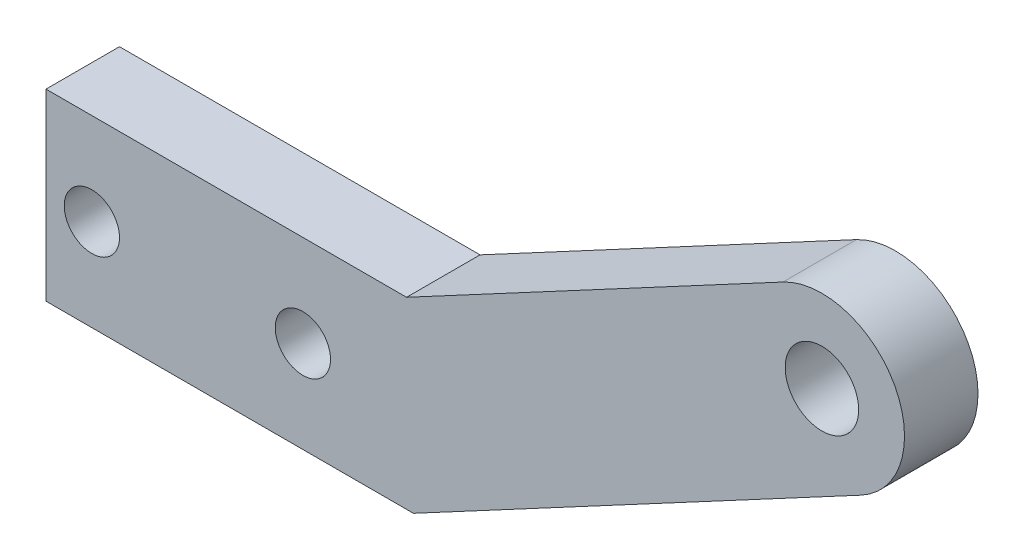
ISO-10303-21;
HEADER;
FILE_DESCRIPTION(('STEP AP214'),'2;1');
FILE_NAME('part.step','',(''),(''),'','','');
FILE_SCHEMA(('AUTOMOTIVE_DESIGN { 1 0 10303 214 1 1 1 1 }'));
ENDSEC;
DATA;
#1=APPLICATION_CONTEXT('core data for automotive mechanical design processes');
#2=APPLICATION_PROTOCOL_DEFINITION('international standard','automotive_design',2000,#1);
#3=PRODUCT_CONTEXT('',#1,'mechanical');
#4=PRODUCT('Part','Part','',(#3));
#5=PRODUCT_RELATED_PRODUCT_CATEGORY('part','',(#4));
#6=PRODUCT_DEFINITION_FORMATION('','',#4);
#7=PRODUCT_DEFINITION_CONTEXT('part definition',#1,'design');
#8=PRODUCT_DEFINITION('design','',#6,#7);
#9=PRODUCT_DEFINITION_SHAPE('','',#8);
#10=(LENGTH_UNIT() NAMED_UNIT(*) SI_UNIT(.MILLI.,.METRE.));
#11=(NAMED_UNIT(*) PLANE_ANGLE_UNIT() SI_UNIT($,.RADIAN.));
#12=(NAMED_UNIT(*) SI_UNIT($,.STERADIAN.) SOLID_ANGLE_UNIT());
#13=UNCERTAINTY_MEASURE_WITH_UNIT(LENGTH_MEASURE(1.E-05),#10,'distance_accuracy_value','');
#14=(GEOMETRIC_REPRESENTATION_CONTEXT(3) GLOBAL_UNCERTAINTY_ASSIGNED_CONTEXT((#13)) GLOBAL_UNIT_ASSIGNED_CONTEXT((#10,
#11,#12)) REPRESENTATION_CONTEXT('',''));
#15=CARTESIAN_POINT('',(0.,0.,0.));
#16=DIRECTION('',(0.,0.,1.));
#17=DIRECTION('',(1.,0.,0.));
#18=AXIS2_PLACEMENT_3D('',#15,#16,#17);
#19=CARTESIAN_POINT('',(67.056,19.05,0.));
#20=DIRECTION('',(0.,0.,1.));
#21=DIRECTION('',(1.,0.,0.));
#22=AXIS2_PLACEMENT_3D('',#19,#20,#21);
#23=PLANE('',#22);
#24=CARTESIAN_POINT('',(67.056,19.05,0.));
#25=DIRECTION('',(0.,0.,1.));
#26=DIRECTION('',(1.,0.,0.));
#27=AXIS2_PLACEMENT_3D('',#24,#25,#26);
#28=CIRCLE('',#27,3.175);
#29=CARTESIAN_POINT('',(70.231,19.05,0.));
#30=VERTEX_POINT('',#29);
#31=EDGE_CURVE('E340',#30,#30,#28,.T.);
#32=ORIENTED_EDGE('',*,*,#31,.T.);
#33=EDGE_LOOP('',(#32));
#34=FACE_BOUND('',#33,.T.);
#35=DIRECTION('',(1.,0.,0.));
#36=VECTOR('',#35,1.);
#37=CARTESIAN_POINT('',(0.,-3.175,0.));
#38=LINE('',#37,#36);
#39=CARTESIAN_POINT('',(0.,-3.175,0.));
#40=VERTEX_POINT('',#39);
#41=CARTESIAN_POINT('',(25.4,-3.175,0.));
#42=VERTEX_POINT('',#41);
#43=EDGE_CURVE('E321',#40,#42,#38,.T.);
#44=ORIENTED_EDGE('',*,*,#43,.T.);
#45=CARTESIAN_POINT('',(25.4,0.,0.));
#46=DIRECTION('',(0.,0.,1.));
#47=DIRECTION('',(1.,0.,0.));
#48=AXIS2_PLACEMENT_3D('',#45,#46,#47);
#49=CIRCLE('',#48,3.175);
#50=CARTESIAN_POINT('',(25.4,3.175,0.));
#51=VERTEX_POINT('',#50);
#52=EDGE_CURVE('E318',#42,#51,#49,.T.);
#53=ORIENTED_EDGE('',*,*,#52,.T.);
#54=DIRECTION('',(-1.,0.,0.));
#55=VECTOR('',#54,1.);
#56=CARTESIAN_POINT('',(0.,3.175,0.));
#57=LINE('',#56,#55);
#58=CARTESIAN_POINT('',(0.,3.175,0.));
#59=VERTEX_POINT('',#58);
#60=EDGE_CURVE('E307',#51,#59,#57,.T.);
#61=ORIENTED_EDGE('',*,*,#60,.T.);
#62=DIRECTION('',(0.,-1.,0.));
#63=VECTOR('',#62,1.);
#64=CARTESIAN_POINT('',(0.,7.9375,0.));
#65=LINE('',#64,#63);
#66=CARTESIAN_POINT('',(0.,7.9375,0.));
#67=VERTEX_POINT('',#66);
#68=EDGE_CURVE('E147',#67,#59,#65,.T.);
#69=ORIENTED_EDGE('',*,*,#68,.F.);
#70=DIRECTION('',(-1.,0.,0.));
#71=VECTOR('',#70,1.);
#72=CARTESIAN_POINT('',(31.1612657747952,7.93750000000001,0.));
#73=LINE('',#72,#71);
#74=CARTESIAN_POINT('',(31.1612657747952,7.93750000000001,0.));
#75=VERTEX_POINT('',#74);
#76=EDGE_CURVE('E88',#75,#67,#73,.T.);
#77=ORIENTED_EDGE('',*,*,#76,.F.);
#78=DIRECTION('',(-0.881702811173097,-0.471805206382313,0.));
#79=VECTOR('',#78,1.);
#80=CARTESIAN_POINT('',(31.1612657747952,7.93750000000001,0.));
#81=LINE('',#80,#79);
#82=CARTESIAN_POINT('',(63.6885375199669,25.3430656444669,0.));
#83=VERTEX_POINT('',#82);
#84=EDGE_CURVE('E143',#83,#75,#81,.T.);
#85=ORIENTED_EDGE('',*,*,#84,.F.);
#86=CARTESIAN_POINT('',(67.056,19.05,0.));
#87=DIRECTION('',(0.,0.,1.));
#88=DIRECTION('',(1.,0.,0.));
#89=AXIS2_PLACEMENT_3D('',#86,#87,#88);
#90=CIRCLE('',#89,7.1374);
#91=CARTESIAN_POINT('',(70.4234624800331,12.7569343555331,0.));
#92=VERTEX_POINT('',#91);
#93=EDGE_CURVE('E123',#92,#83,#90,.T.);
#94=ORIENTED_EDGE('',*,*,#93,.F.);
#95=DIRECTION('',(0.881702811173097,0.471805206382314,0.));
#96=VECTOR('',#95,1.);
#97=CARTESIAN_POINT('',(31.75,-7.9375,0.));
#98=LINE('',#97,#96);
#99=CARTESIAN_POINT('',(31.75,-7.9375,0.));
#100=VERTEX_POINT('',#99);
#101=EDGE_CURVE('E139',#100,#92,#98,.T.);
#102=ORIENTED_EDGE('',*,*,#101,.F.);
#103=DIRECTION('',(1.,0.,0.));
#104=VECTOR('',#103,1.);
#105=CARTESIAN_POINT('',(0.,-7.9375,0.));
#106=LINE('',#105,#104);
#107=CARTESIAN_POINT('',(0.,-7.9375,0.));
#108=VERTEX_POINT('',#107);
#109=EDGE_CURVE('E137',#108,#100,#106,.T.);
#110=ORIENTED_EDGE('',*,*,#109,.F.);
#111=EDGE_CURVE('E146',#40,#108,#65,.T.);
#112=ORIENTED_EDGE('',*,*,#111,.F.);
#113=EDGE_LOOP('',(#44,#53,#61,#69,#77,#85,#94,#102,#110,#112));
#114=FACE_BOUND('',#113,.T.);
#115=ADVANCED_FACE('F34',(#34,#114),#23,.F.);
#116=CARTESIAN_POINT('',(0.,7.9375,6.35));
#117=DIRECTION('',(1.,0.,0.));
#118=DIRECTION('',(0.,1.,0.));
#119=AXIS2_PLACEMENT_3D('',#116,#117,#118);
#120=PLANE('',#119);
#121=DIRECTION('',(0.,0.,-1.));
#122=VECTOR('',#121,1.);
#123=CARTESIAN_POINT('',(0.,-3.175,2.794));
#124=LINE('',#123,#122);
#125=CARTESIAN_POINT('',(0.,-3.175,2.794));
#126=VERTEX_POINT('',#125);
#127=EDGE_CURVE('E50',#126,#40,#124,.T.);
#128=ORIENTED_EDGE('',*,*,#127,.T.);
#129=ORIENTED_EDGE('',*,*,#111,.T.);
#130=DIRECTION('',(0.,0.,-1.));
#131=VECTOR('',#130,1.);
#132=CARTESIAN_POINT('',(0.,-7.9375,6.35));
#133=LINE('',#132,#131);
#134=CARTESIAN_POINT('',(0.,-7.9375,6.35));
#135=VERTEX_POINT('',#134);
#136=EDGE_CURVE('E11',#135,#108,#133,.T.);
#137=ORIENTED_EDGE('',*,*,#136,.F.);
#138=DIRECTION('',(0.,-1.,0.));
#139=VECTOR('',#138,1.);
#140=CARTESIAN_POINT('',(0.,0.,6.35));
#141=LINE('',#140,#139);
#142=CARTESIAN_POINT('',(0.,7.9375,6.35));
#143=VERTEX_POINT('',#142);
#144=EDGE_CURVE('E59',#143,#135,#141,.T.);
#145=ORIENTED_EDGE('',*,*,#144,.F.);
#146=DIRECTION('',(0.,0.,-1.));
#147=VECTOR('',#146,1.);
#148=CARTESIAN_POINT('',(0.,7.9375,6.35));
#149=LINE('',#148,#147);
#150=EDGE_CURVE('E133',#143,#67,#149,.T.);
#151=ORIENTED_EDGE('',*,*,#150,.T.);
#152=ORIENTED_EDGE('',*,*,#68,.T.);
#153=DIRECTION('',(0.,0.,-1.));
#154=VECTOR('',#153,1.);
#155=CARTESIAN_POINT('',(0.,3.175,2.794));
#156=LINE('',#155,#154);
#157=CARTESIAN_POINT('',(0.,3.175,2.794));
#158=VERTEX_POINT('',#157);
#159=EDGE_CURVE('E315',#158,#59,#156,.T.);
#160=ORIENTED_EDGE('',*,*,#159,.F.);
#161=DIRECTION('',(0.,-1.,0.));
#162=VECTOR('',#161,1.);
#163=CARTESIAN_POINT('',(0.,7.9375,2.794));
#164=LINE('',#163,#162);
#165=EDGE_CURVE('E337',#158,#126,#164,.T.);
#166=ORIENTED_EDGE('',*,*,#165,.T.);
#167=EDGE_LOOP('',(#128,#129,#137,#145,#151,#152,#160,#166));
#168=FACE_BOUND('',#167,.T.);
#169=ADVANCED_FACE('F164',(#168),#120,.F.);
#170=CARTESIAN_POINT('',(67.056,19.05,6.35));
#171=DIRECTION('',(0.,0.,1.));
#172=DIRECTION('',(1.,0.,0.));
#173=AXIS2_PLACEMENT_3D('',#170,#171,#172);
#174=PLANE('',#173);
#175=CARTESIAN_POINT('',(22.1996,0.,6.35));
#176=DIRECTION('',(0.,0.,1.));
#177=DIRECTION('',(1.,0.,0.));
#178=AXIS2_PLACEMENT_3D('',#175,#176,#177);
#179=CIRCLE('',#178,2.3876);
#180=CARTESIAN_POINT('',(24.5872,0.,6.35));
#181=VERTEX_POINT('',#180);
#182=EDGE_CURVE('E344',#181,#181,#179,.T.);
#183=ORIENTED_EDGE('',*,*,#182,.F.);
#184=EDGE_LOOP('',(#183));
#185=FACE_BOUND('',#184,.T.);
#186=ORIENTED_EDGE('',*,*,#144,.T.);
#187=DIRECTION('',(1.,0.,0.));
#188=VECTOR('',#187,1.);
#189=CARTESIAN_POINT('',(0.,-7.9375,6.35));
#190=LINE('',#189,#188);
#191=CARTESIAN_POINT('',(31.75,-7.9375,6.35));
#192=VERTEX_POINT('',#191);
#193=EDGE_CURVE('E95',#135,#192,#190,.T.);
#194=ORIENTED_EDGE('',*,*,#193,.T.);
#195=DIRECTION('',(0.881702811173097,0.471805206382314,0.));
#196=VECTOR('',#195,1.);
#197=CARTESIAN_POINT('',(31.75,-7.9375,6.35));
#198=LINE('',#197,#196);
#199=CARTESIAN_POINT('',(70.4234624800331,12.7569343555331,6.35));
#200=VERTEX_POINT('',#199);
#201=EDGE_CURVE('E114',#192,#200,#198,.T.);
#202=ORIENTED_EDGE('',*,*,#201,.T.);
#203=CARTESIAN_POINT('',(67.056,19.05,6.35));
#204=DIRECTION('',(0.,0.,1.));
#205=DIRECTION('',(1.,0.,0.));
#206=AXIS2_PLACEMENT_3D('',#203,#204,#205);
#207=CIRCLE('',#206,7.1374);
#208=CARTESIAN_POINT('',(63.6885375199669,25.3430656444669,6.35));
#209=VERTEX_POINT('',#208);
#210=EDGE_CURVE('E106',#200,#209,#207,.T.);
#211=ORIENTED_EDGE('',*,*,#210,.T.);
#212=DIRECTION('',(-0.881702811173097,-0.471805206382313,0.));
#213=VECTOR('',#212,1.);
#214=CARTESIAN_POINT('',(31.1612657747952,7.93750000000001,6.35));
#215=LINE('',#214,#213);
#216=CARTESIAN_POINT('',(31.1612657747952,7.93750000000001,6.35));
#217=VERTEX_POINT('',#216);
#218=EDGE_CURVE('E111',#209,#217,#215,.T.);
#219=ORIENTED_EDGE('',*,*,#218,.T.);
#220=DIRECTION('',(-1.,0.,0.));
#221=VECTOR('',#220,1.);
#222=CARTESIAN_POINT('',(31.1612657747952,7.93750000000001,6.35));
#223=LINE('',#222,#221);
#224=EDGE_CURVE('E131',#217,#143,#223,.T.);
#225=ORIENTED_EDGE('',*,*,#224,.T.);
#226=EDGE_LOOP('',(#186,#194,#202,#211,#219,#225));
#227=FACE_BOUND('',#226,.T.);
#228=CARTESIAN_POINT('',(3.9624,0.,6.35));
#229=DIRECTION('',(0.,0.,1.));
#230=DIRECTION('',(1.,0.,0.));
#231=AXIS2_PLACEMENT_3D('',#228,#229,#230);
#232=CIRCLE('',#231,2.3876);
#233=CARTESIAN_POINT('',(6.35,0.,6.35));
#234=VERTEX_POINT('',#233);
#235=EDGE_CURVE('E140',#234,#234,#232,.T.);
#236=ORIENTED_EDGE('',*,*,#235,.F.);
#237=EDGE_LOOP('',(#236));
#238=FACE_BOUND('',#237,.T.);
#239=CARTESIAN_POINT('',(67.056,19.05,6.35));
#240=DIRECTION('',(0.,0.,1.));
#241=DIRECTION('',(1.,0.,0.));
#242=AXIS2_PLACEMENT_3D('',#239,#240,#241);
#243=CIRCLE('',#242,3.175);
#244=CARTESIAN_POINT('',(70.231,19.05,6.35));
#245=VERTEX_POINT('',#244);
#246=EDGE_CURVE('E341',#245,#245,#243,.T.);
#247=ORIENTED_EDGE('',*,*,#246,.F.);
#248=EDGE_LOOP('',(#247));
#249=FACE_BOUND('',#248,.T.);
#250=ADVANCED_FACE('F108',(#185,#227,#238,#249),#174,.T.);
#251=CARTESIAN_POINT('',(0.,-7.9375,6.35));
#252=DIRECTION('',(0.,1.,0.));
#253=DIRECTION('',(-1.,0.,0.));
#254=AXIS2_PLACEMENT_3D('',#251,#252,#253);
#255=PLANE('',#254);
#256=ORIENTED_EDGE('',*,*,#109,.T.);
#257=DIRECTION('',(0.,0.,-1.));
#258=VECTOR('',#257,1.);
#259=CARTESIAN_POINT('',(31.75,-7.9375,6.35));
#260=LINE('',#259,#258);
#261=EDGE_CURVE('E43',#192,#100,#260,.T.);
#262=ORIENTED_EDGE('',*,*,#261,.F.);
#263=ORIENTED_EDGE('',*,*,#193,.F.);
#264=ORIENTED_EDGE('',*,*,#136,.T.);
#265=EDGE_LOOP('',(#256,#262,#263,#264));
#266=FACE_BOUND('',#265,.T.);
#267=ADVANCED_FACE('F36',(#266),#255,.F.);
#268=CARTESIAN_POINT('',(31.75,-7.9375,6.35));
#269=DIRECTION('',(-0.471805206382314,0.881702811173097,0.));
#270=DIRECTION('',(-0.881702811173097,-0.471805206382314,0.));
#271=AXIS2_PLACEMENT_3D('',#268,#269,#270);
#272=PLANE('',#271);
#273=ORIENTED_EDGE('',*,*,#101,.T.);
#274=DIRECTION('',(0.,0.,-1.));
#275=VECTOR('',#274,1.);
#276=CARTESIAN_POINT('',(70.4234624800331,12.7569343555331,6.35));
#277=LINE('',#276,#275);
#278=EDGE_CURVE('E126',#200,#92,#277,.T.);
#279=ORIENTED_EDGE('',*,*,#278,.F.);
#280=ORIENTED_EDGE('',*,*,#201,.F.);
#281=ORIENTED_EDGE('',*,*,#261,.T.);
#282=EDGE_LOOP('',(#273,#279,#280,#281));
#283=FACE_BOUND('',#282,.T.);
#284=ADVANCED_FACE('F156',(#283),#272,.F.);
#285=CARTESIAN_POINT('',(67.056,19.05,6.35));
#286=DIRECTION('',(0.,0.,-1.));
#287=DIRECTION('',(-1.,0.,0.));
#288=AXIS2_PLACEMENT_3D('',#285,#286,#287);
#289=CYLINDRICAL_SURFACE('',#288,7.1374);
#290=ORIENTED_EDGE('',*,*,#93,.T.);
#291=DIRECTION('',(0.,0.,-1.));
#292=VECTOR('',#291,1.);
#293=CARTESIAN_POINT('',(63.6885375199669,25.3430656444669,6.35));
#294=LINE('',#293,#292);
#295=EDGE_CURVE('E120',#209,#83,#294,.T.);
#296=ORIENTED_EDGE('',*,*,#295,.F.);
#297=ORIENTED_EDGE('',*,*,#210,.F.);
#298=ORIENTED_EDGE('',*,*,#278,.T.);
#299=EDGE_LOOP('',(#290,#296,#297,#298));
#300=FACE_BOUND('',#299,.T.);
#301=ADVANCED_FACE('F121',(#300),#289,.T.);
#302=CARTESIAN_POINT('',(31.1612657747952,7.93750000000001,6.35));
#303=DIRECTION('',(0.471805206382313,-0.881702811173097,0.));
#304=DIRECTION('',(0.881702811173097,0.471805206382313,0.));
#305=AXIS2_PLACEMENT_3D('',#302,#303,#304);
#306=PLANE('',#305);
#307=ORIENTED_EDGE('',*,*,#84,.T.);
#308=DIRECTION('',(0.,0.,-1.));
#309=VECTOR('',#308,1.);
#310=CARTESIAN_POINT('',(31.1612657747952,7.93750000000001,6.35));
#311=LINE('',#310,#309);
#312=EDGE_CURVE('E127',#217,#75,#311,.T.);
#313=ORIENTED_EDGE('',*,*,#312,.F.);
#314=ORIENTED_EDGE('',*,*,#218,.F.);
#315=ORIENTED_EDGE('',*,*,#295,.T.);
#316=EDGE_LOOP('',(#307,#313,#314,#315));
#317=FACE_BOUND('',#316,.T.);
#318=ADVANCED_FACE('F129',(#317),#306,.F.);
#319=CARTESIAN_POINT('',(31.1612657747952,7.93750000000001,6.35));
#320=DIRECTION('',(0.,-1.,0.));
#321=DIRECTION('',(1.,0.,0.));
#322=AXIS2_PLACEMENT_3D('',#319,#320,#321);
#323=PLANE('',#322);
#324=ORIENTED_EDGE('',*,*,#76,.T.);
#325=ORIENTED_EDGE('',*,*,#150,.F.);
#326=ORIENTED_EDGE('',*,*,#224,.F.);
#327=ORIENTED_EDGE('',*,*,#312,.T.);
#328=EDGE_LOOP('',(#324,#325,#326,#327));
#329=FACE_BOUND('',#328,.T.);
#330=ADVANCED_FACE('F162',(#329),#323,.F.);
#331=CARTESIAN_POINT('',(3.9624,0.,6.35));
#332=DIRECTION('',(0.,0.,-1.));
#333=DIRECTION('',(-1.,0.,0.));
#334=AXIS2_PLACEMENT_3D('',#331,#332,#333);
#335=CYLINDRICAL_SURFACE('',#334,2.3876);
#336=CARTESIAN_POINT('',(3.9624,0.,2.794));
#337=DIRECTION('',(0.,0.,1.));
#338=DIRECTION('',(1.,0.,0.));
#339=AXIS2_PLACEMENT_3D('',#336,#337,#338);
#340=CIRCLE('',#339,2.3876);
#341=CARTESIAN_POINT('',(6.35,0.,2.794));
#342=VERTEX_POINT('',#341);
#343=EDGE_CURVE('E334',#342,#342,#340,.T.);
#344=ORIENTED_EDGE('',*,*,#343,.F.);
#345=EDGE_LOOP('',(#344));
#346=FACE_BOUND('',#345,.T.);
#347=ORIENTED_EDGE('',*,*,#235,.T.);
#348=EDGE_LOOP('',(#347));
#349=FACE_BOUND('',#348,.T.);
#350=ADVANCED_FACE('F184',(#346,#349),#335,.F.);
#351=CARTESIAN_POINT('',(22.1996,0.,6.35));
#352=DIRECTION('',(0.,0.,-1.));
#353=DIRECTION('',(-1.,0.,0.));
#354=AXIS2_PLACEMENT_3D('',#351,#352,#353);
#355=CYLINDRICAL_SURFACE('',#354,2.3876);
#356=CARTESIAN_POINT('',(22.1996,0.,2.794));
#357=DIRECTION('',(0.,0.,1.));
#358=DIRECTION('',(1.,0.,0.));
#359=AXIS2_PLACEMENT_3D('',#356,#357,#358);
#360=CIRCLE('',#359,2.3876);
#361=CARTESIAN_POINT('',(24.5872,0.,2.794));
#362=VERTEX_POINT('',#361);
#363=EDGE_CURVE('E38',#362,#362,#360,.T.);
#364=ORIENTED_EDGE('',*,*,#363,.F.);
#365=EDGE_LOOP('',(#364));
#366=FACE_BOUND('',#365,.T.);
#367=ORIENTED_EDGE('',*,*,#182,.T.);
#368=EDGE_LOOP('',(#367));
#369=FACE_BOUND('',#368,.T.);
#370=ADVANCED_FACE('F207',(#366,#369),#355,.F.);
#371=CARTESIAN_POINT('',(67.056,19.05,6.35));
#372=DIRECTION('',(0.,0.,-1.));
#373=DIRECTION('',(-1.,0.,0.));
#374=AXIS2_PLACEMENT_3D('',#371,#372,#373);
#375=CYLINDRICAL_SURFACE('',#374,3.175);
#376=ORIENTED_EDGE('',*,*,#246,.T.);
#377=EDGE_LOOP('',(#376));
#378=FACE_BOUND('',#377,.T.);
#379=ORIENTED_EDGE('',*,*,#31,.F.);
#380=EDGE_LOOP('',(#379));
#381=FACE_BOUND('',#380,.T.);
#382=ADVANCED_FACE('F215',(#378,#381),#375,.F.);
#383=CARTESIAN_POINT('',(0.,0.,2.794));
#384=DIRECTION('',(0.,0.,1.));
#385=DIRECTION('',(1.,0.,0.));
#386=AXIS2_PLACEMENT_3D('',#383,#384,#385);
#387=PLANE('',#386);
#388=ORIENTED_EDGE('',*,*,#363,.T.);
#389=EDGE_LOOP('',(#388));
#390=FACE_BOUND('',#389,.T.);
#391=ORIENTED_EDGE('',*,*,#343,.T.);
#392=EDGE_LOOP('',(#391));
#393=FACE_BOUND('',#392,.T.);
#394=DIRECTION('',(-1.,0.,0.));
#395=VECTOR('',#394,1.);
#396=CARTESIAN_POINT('',(0.,3.175,2.794));
#397=LINE('',#396,#395);
#398=CARTESIAN_POINT('',(25.4,3.175,2.794));
#399=VERTEX_POINT('',#398);
#400=EDGE_CURVE('E328',#399,#158,#397,.T.);
#401=ORIENTED_EDGE('',*,*,#400,.F.);
#402=CARTESIAN_POINT('',(25.4,0.,2.794));
#403=DIRECTION('',(0.,0.,1.));
#404=DIRECTION('',(1.,0.,0.));
#405=AXIS2_PLACEMENT_3D('',#402,#403,#404);
#406=CIRCLE('',#405,3.175);
#407=CARTESIAN_POINT('',(25.4,-3.175,2.794));
#408=VERTEX_POINT('',#407);
#409=EDGE_CURVE('E363',#408,#399,#406,.T.);
#410=ORIENTED_EDGE('',*,*,#409,.F.);
#411=DIRECTION('',(1.,0.,0.));
#412=VECTOR('',#411,1.);
#413=CARTESIAN_POINT('',(0.,-3.175,2.794));
#414=LINE('',#413,#412);
#415=EDGE_CURVE('E317',#126,#408,#414,.T.);
#416=ORIENTED_EDGE('',*,*,#415,.F.);
#417=ORIENTED_EDGE('',*,*,#165,.F.);
#418=EDGE_LOOP('',(#401,#410,#416,#417));
#419=FACE_BOUND('',#418,.T.);
#420=ADVANCED_FACE('F223',(#390,#393,#419),#387,.F.);
#421=CARTESIAN_POINT('',(0.,-3.175,2.794));
#422=DIRECTION('',(0.,1.,0.));
#423=DIRECTION('',(0.,0.,1.));
#424=AXIS2_PLACEMENT_3D('',#421,#422,#423);
#425=PLANE('',#424);
#426=ORIENTED_EDGE('',*,*,#43,.F.);
#427=ORIENTED_EDGE('',*,*,#127,.F.);
#428=ORIENTED_EDGE('',*,*,#415,.T.);
#429=DIRECTION('',(0.,0.,-1.));
#430=VECTOR('',#429,1.);
#431=CARTESIAN_POINT('',(25.4,-3.175,2.794));
#432=LINE('',#431,#430);
#433=EDGE_CURVE('E330',#408,#42,#432,.T.);
#434=ORIENTED_EDGE('',*,*,#433,.T.);
#435=EDGE_LOOP('',(#426,#427,#428,#434));
#436=FACE_BOUND('',#435,.T.);
#437=ADVANCED_FACE('F230',(#436),#425,.T.);
#438=CARTESIAN_POINT('',(25.4,0.,2.794));
#439=DIRECTION('',(0.,0.,-1.));
#440=DIRECTION('',(-1.,0.,0.));
#441=AXIS2_PLACEMENT_3D('',#438,#439,#440);
#442=CYLINDRICAL_SURFACE('',#441,3.175);
#443=ORIENTED_EDGE('',*,*,#52,.F.);
#444=ORIENTED_EDGE('',*,*,#433,.F.);
#445=ORIENTED_EDGE('',*,*,#409,.T.);
#446=DIRECTION('',(0.,0.,-1.));
#447=VECTOR('',#446,1.);
#448=CARTESIAN_POINT('',(25.4,3.175,2.794));
#449=LINE('',#448,#447);
#450=EDGE_CURVE('E312',#399,#51,#449,.T.);
#451=ORIENTED_EDGE('',*,*,#450,.T.);
#452=EDGE_LOOP('',(#443,#444,#445,#451));
#453=FACE_BOUND('',#452,.T.);
#454=ADVANCED_FACE('F238',(#453),#442,.F.);
#455=CARTESIAN_POINT('',(0.,3.175,2.794));
#456=DIRECTION('',(0.,-1.,0.));
#457=DIRECTION('',(0.,0.,-1.));
#458=AXIS2_PLACEMENT_3D('',#455,#456,#457);
#459=PLANE('',#458);
#460=ORIENTED_EDGE('',*,*,#60,.F.);
#461=ORIENTED_EDGE('',*,*,#450,.F.);
#462=ORIENTED_EDGE('',*,*,#400,.T.);
#463=ORIENTED_EDGE('',*,*,#159,.T.);
#464=EDGE_LOOP('',(#460,#461,#462,#463));
#465=FACE_BOUND('',#464,.T.);
#466=ADVANCED_FACE('F245',(#465),#459,.T.);
#467=CLOSED_SHELL('',(#115,#169,#250,#267,#284,#301,#318,#330,#350,#370,#382,#420,#437,#454,#466));
#468=MANIFOLD_SOLID_BREP('B2',#467);
#469=ADVANCED_BREP_SHAPE_REPRESENTATION('',(#18,#468),#14);
#470=SHAPE_DEFINITION_REPRESENTATION(#9,#469);
ENDSEC;
END-ISO-10303-21;
